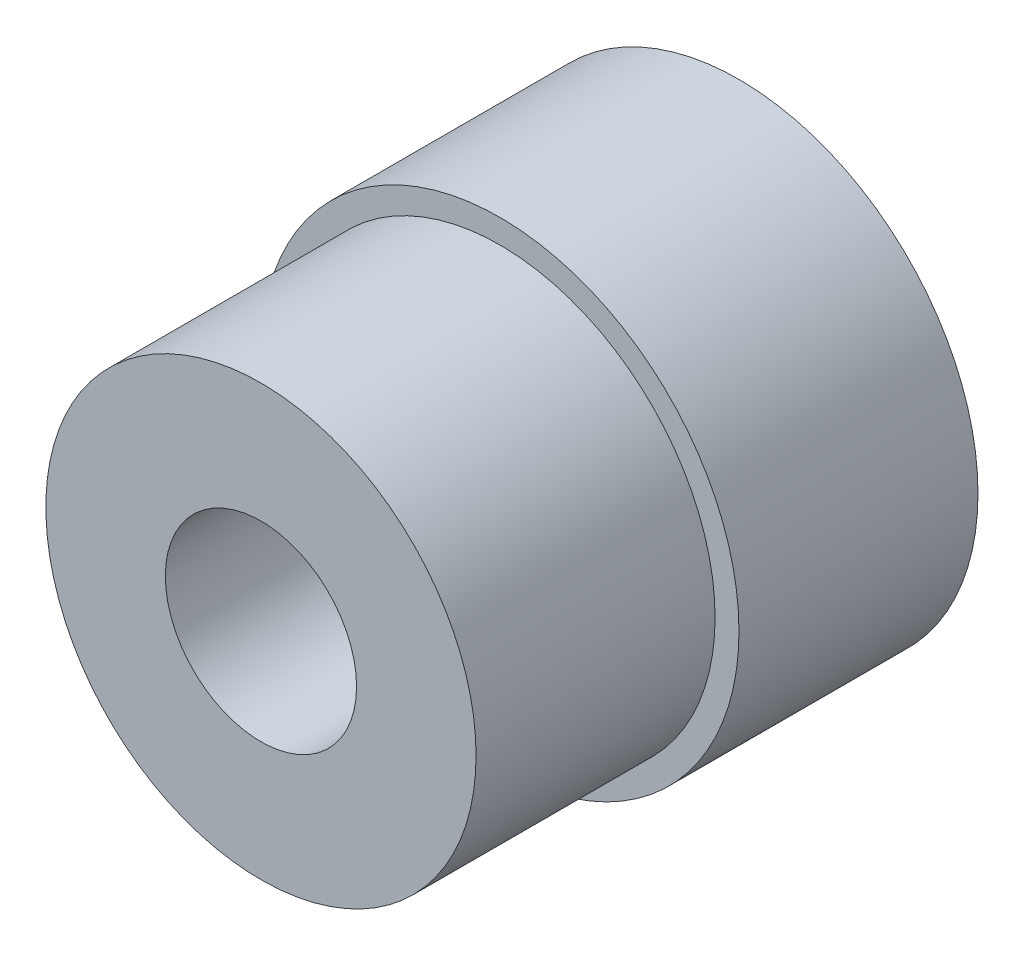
from build123d import *

# Parameters (mm, degrees)
SKETCH_1_R      = 10
EXTRUDE_1_DEPTH = 10
SKETCH_2_R      = 9
SKETCH_2_R_2    = 4
EXTRUDE_2_DEPTH = 10


with BuildPart() as part:
    # Sketch 1 → Extrude 1 (new body)
    with BuildSketch(Plane.XY):
        Circle(SKETCH_1_R)
    extrude(amount=EXTRUDE_1_DEPTH)

    # Sketch 2 → Extrude 2 (add)
    with BuildSketch(Plane.XY.offset(10)):
        Circle(SKETCH_2_R)
        Circle(SKETCH_2_R_2, mode=Mode.SUBTRACT)
    extrude(amount=EXTRUDE_2_DEPTH)


solid = part.part
